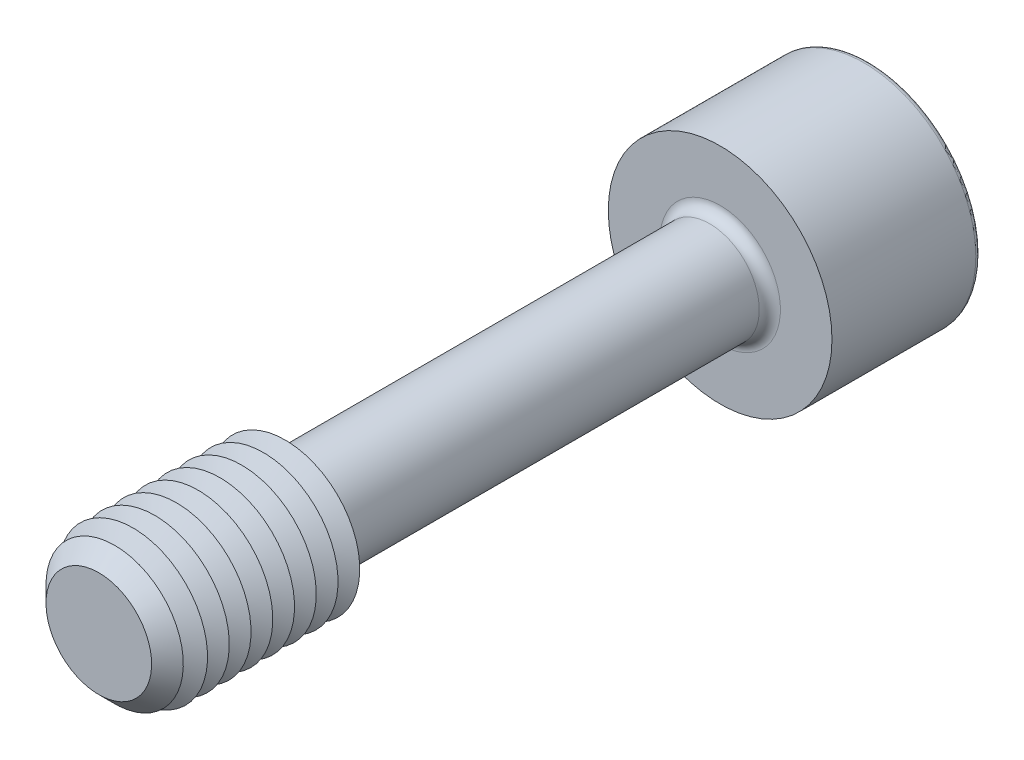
ISO-10303-21;
HEADER;
FILE_DESCRIPTION(('STEP AP214'),'2;1');
FILE_NAME('part.step','',(''),(''),'','','');
FILE_SCHEMA(('AUTOMOTIVE_DESIGN { 1 0 10303 214 1 1 1 1 }'));
ENDSEC;
DATA;
#1=APPLICATION_CONTEXT('core data for automotive mechanical design processes');
#2=APPLICATION_PROTOCOL_DEFINITION('international standard','automotive_design',2000,#1);
#3=PRODUCT_CONTEXT('',#1,'mechanical');
#4=PRODUCT('Part','Part','',(#3));
#5=PRODUCT_RELATED_PRODUCT_CATEGORY('part','',(#4));
#6=PRODUCT_DEFINITION_FORMATION('','',#4);
#7=PRODUCT_DEFINITION_CONTEXT('part definition',#1,'design');
#8=PRODUCT_DEFINITION('design','',#6,#7);
#9=PRODUCT_DEFINITION_SHAPE('','',#8);
#10=(LENGTH_UNIT() NAMED_UNIT(*) SI_UNIT(.MILLI.,.METRE.));
#11=(NAMED_UNIT(*) PLANE_ANGLE_UNIT() SI_UNIT($,.RADIAN.));
#12=(NAMED_UNIT(*) SI_UNIT($,.STERADIAN.) SOLID_ANGLE_UNIT());
#13=UNCERTAINTY_MEASURE_WITH_UNIT(LENGTH_MEASURE(1.E-05),#10,'distance_accuracy_value','');
#14=(GEOMETRIC_REPRESENTATION_CONTEXT(3) GLOBAL_UNCERTAINTY_ASSIGNED_CONTEXT((#13)) GLOBAL_UNIT_ASSIGNED_CONTEXT((#10,
#11,#12)) REPRESENTATION_CONTEXT('',''));
#15=CARTESIAN_POINT('',(0.,0.,0.));
#16=DIRECTION('',(0.,0.,1.));
#17=DIRECTION('',(1.,0.,0.));
#18=AXIS2_PLACEMENT_3D('',#15,#16,#17);
#19=CARTESIAN_POINT('',(-2.88675134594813,-5.,-27.));
#20=DIRECTION('',(0.,0.,1.));
#21=DIRECTION('',(1.,0.,0.));
#22=AXIS2_PLACEMENT_3D('',#19,#20,#21);
#23=PLANE('',#22);
#24=DIRECTION('',(1.,0.,0.));
#25=VECTOR('',#24,1.);
#26=CARTESIAN_POINT('',(-2.88675134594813,-5.,-27.));
#27=LINE('',#26,#25);
#28=CARTESIAN_POINT('',(0.,-5.,-27.));
#29=VERTEX_POINT('',#28);
#30=CARTESIAN_POINT('',(2.88675134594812,-5.,-27.));
#31=VERTEX_POINT('',#30);
#32=EDGE_CURVE('E762',#29,#31,#27,.T.);
#33=ORIENTED_EDGE('',*,*,#32,.F.);
#34=CARTESIAN_POINT('',(0.,0.,-27.));
#35=DIRECTION('',(0.,0.,1.));
#36=DIRECTION('',(0.,-1.,0.));
#37=AXIS2_PLACEMENT_3D('',#34,#35,#36);
#38=CIRCLE('',#37,5.);
#39=CARTESIAN_POINT('',(4.3301270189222,-2.5,-27.));
#40=VERTEX_POINT('',#39);
#41=EDGE_CURVE('E53',#29,#40,#38,.T.);
#42=ORIENTED_EDGE('',*,*,#41,.T.);
#43=DIRECTION('',(0.5,0.866025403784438,0.));
#44=VECTOR('',#43,1.);
#45=CARTESIAN_POINT('',(2.88675134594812,-5.,-27.));
#46=LINE('',#45,#44);
#47=EDGE_CURVE('E748',#31,#40,#46,.T.);
#48=ORIENTED_EDGE('',*,*,#47,.F.);
#49=EDGE_LOOP('',(#33,#42,#48));
#50=FACE_BOUND('',#49,.T.);
#51=ADVANCED_FACE('F41',(#50),#23,.F.);
#52=CARTESIAN_POINT('',(5.77350269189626,0.,-27.));
#53=VERTEX_POINT('',#52);
#54=EDGE_CURVE('E759',#40,#53,#46,.T.);
#55=ORIENTED_EDGE('',*,*,#54,.F.);
#56=CARTESIAN_POINT('',(4.3301270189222,2.50000000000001,-27.));
#57=VERTEX_POINT('',#56);
#58=EDGE_CURVE('E11',#40,#57,#38,.T.);
#59=ORIENTED_EDGE('',*,*,#58,.T.);
#60=DIRECTION('',(-0.5,0.866025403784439,0.));
#61=VECTOR('',#60,1.);
#62=CARTESIAN_POINT('',(5.77350269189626,0.,-27.));
#63=LINE('',#62,#61);
#64=EDGE_CURVE('E747',#53,#57,#63,.T.);
#65=ORIENTED_EDGE('',*,*,#64,.F.);
#66=EDGE_LOOP('',(#55,#59,#65));
#67=FACE_BOUND('',#66,.T.);
#68=ADVANCED_FACE('F133',(#67),#23,.F.);
#69=CARTESIAN_POINT('',(2.88675134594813,5.,-27.));
#70=VERTEX_POINT('',#69);
#71=EDGE_CURVE('E742',#57,#70,#63,.T.);
#72=ORIENTED_EDGE('',*,*,#71,.F.);
#73=CARTESIAN_POINT('',(0.,5.00000000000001,-27.));
#74=VERTEX_POINT('',#73);
#75=EDGE_CURVE('E51',#57,#74,#38,.T.);
#76=ORIENTED_EDGE('',*,*,#75,.T.);
#77=DIRECTION('',(-1.,0.,0.));
#78=VECTOR('',#77,1.);
#79=CARTESIAN_POINT('',(2.88675134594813,5.,-27.));
#80=LINE('',#79,#78);
#81=EDGE_CURVE('E177',#70,#74,#80,.T.);
#82=ORIENTED_EDGE('',*,*,#81,.F.);
#83=EDGE_LOOP('',(#72,#76,#82));
#84=FACE_BOUND('',#83,.T.);
#85=ADVANCED_FACE('F139',(#84),#23,.F.);
#86=CARTESIAN_POINT('',(-2.88675134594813,5.,-27.));
#87=VERTEX_POINT('',#86);
#88=EDGE_CURVE('E753',#74,#87,#80,.T.);
#89=ORIENTED_EDGE('',*,*,#88,.F.);
#90=CARTESIAN_POINT('',(-4.3301270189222,2.50000000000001,-27.));
#91=VERTEX_POINT('',#90);
#92=EDGE_CURVE('E266',#74,#91,#38,.T.);
#93=ORIENTED_EDGE('',*,*,#92,.T.);
#94=DIRECTION('',(-0.5,-0.866025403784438,0.));
#95=VECTOR('',#94,1.);
#96=CARTESIAN_POINT('',(-2.88675134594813,5.,-27.));
#97=LINE('',#96,#95);
#98=EDGE_CURVE('E176',#87,#91,#97,.T.);
#99=ORIENTED_EDGE('',*,*,#98,.F.);
#100=EDGE_LOOP('',(#89,#93,#99));
#101=FACE_BOUND('',#100,.T.);
#102=ADVANCED_FACE('F157',(#101),#23,.F.);
#103=CARTESIAN_POINT('',(-5.77350269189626,0.,-27.));
#104=VERTEX_POINT('',#103);
#105=EDGE_CURVE('E170',#91,#104,#97,.T.);
#106=ORIENTED_EDGE('',*,*,#105,.F.);
#107=CARTESIAN_POINT('',(-4.3301270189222,-2.5,-27.));
#108=VERTEX_POINT('',#107);
#109=EDGE_CURVE('E172',#91,#108,#38,.T.);
#110=ORIENTED_EDGE('',*,*,#109,.T.);
#111=DIRECTION('',(0.5,-0.866025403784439,0.));
#112=VECTOR('',#111,1.);
#113=CARTESIAN_POINT('',(-5.77350269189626,0.,-27.));
#114=LINE('',#113,#112);
#115=EDGE_CURVE('E174',#104,#108,#114,.T.);
#116=ORIENTED_EDGE('',*,*,#115,.F.);
#117=EDGE_LOOP('',(#106,#110,#116));
#118=FACE_BOUND('',#117,.T.);
#119=ADVANCED_FACE('F146',(#118),#23,.F.);
#120=CARTESIAN_POINT('',(0.,0.,-37.));
#121=DIRECTION('',(0.,0.,-1.));
#122=DIRECTION('',(-1.,0.,0.));
#123=AXIS2_PLACEMENT_3D('',#120,#121,#122);
#124=PLANE('',#123);
#125=CARTESIAN_POINT('',(0.,0.,-37.));
#126=DIRECTION('',(0.,0.,-1.));
#127=DIRECTION('',(-1.,0.,0.));
#128=AXIS2_PLACEMENT_3D('',#125,#126,#127);
#129=CIRCLE('',#128,8.575);
#130=CARTESIAN_POINT('',(-8.575,0.,-37.));
#131=VERTEX_POINT('',#130);
#132=EDGE_CURVE('E251',#131,#131,#129,.T.);
#133=ORIENTED_EDGE('',*,*,#132,.T.);
#134=EDGE_LOOP('',(#133));
#135=FACE_BOUND('',#134,.T.);
#136=DIRECTION('',(-0.5,-0.866025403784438,0.));
#137=VECTOR('',#136,1.);
#138=CARTESIAN_POINT('',(-2.88675134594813,5.,-37.));
#139=LINE('',#138,#137);
#140=CARTESIAN_POINT('',(-2.88675134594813,5.,-37.));
#141=VERTEX_POINT('',#140);
#142=CARTESIAN_POINT('',(-5.77350269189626,0.,-37.));
#143=VERTEX_POINT('',#142);
#144=EDGE_CURVE('E212',#141,#143,#139,.T.);
#145=ORIENTED_EDGE('',*,*,#144,.T.);
#146=DIRECTION('',(0.5,-0.866025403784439,0.));
#147=VECTOR('',#146,1.);
#148=CARTESIAN_POINT('',(-5.77350269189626,0.,-37.));
#149=LINE('',#148,#147);
#150=CARTESIAN_POINT('',(-2.88675134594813,-5.,-37.));
#151=VERTEX_POINT('',#150);
#152=EDGE_CURVE('E67',#143,#151,#149,.T.);
#153=ORIENTED_EDGE('',*,*,#152,.T.);
#154=DIRECTION('',(1.,0.,0.));
#155=VECTOR('',#154,1.);
#156=CARTESIAN_POINT('',(-2.88675134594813,-5.,-37.));
#157=LINE('',#156,#155);
#158=CARTESIAN_POINT('',(2.88675134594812,-5.,-37.));
#159=VERTEX_POINT('',#158);
#160=EDGE_CURVE('E196',#151,#159,#157,.T.);
#161=ORIENTED_EDGE('',*,*,#160,.T.);
#162=DIRECTION('',(0.5,0.866025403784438,0.));
#163=VECTOR('',#162,1.);
#164=CARTESIAN_POINT('',(2.88675134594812,-5.,-37.));
#165=LINE('',#164,#163);
#166=CARTESIAN_POINT('',(5.77350269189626,0.,-37.));
#167=VERTEX_POINT('',#166);
#168=EDGE_CURVE('E200',#159,#167,#165,.T.);
#169=ORIENTED_EDGE('',*,*,#168,.T.);
#170=DIRECTION('',(-0.5,0.866025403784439,0.));
#171=VECTOR('',#170,1.);
#172=CARTESIAN_POINT('',(5.77350269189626,0.,-37.));
#173=LINE('',#172,#171);
#174=CARTESIAN_POINT('',(2.88675134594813,5.,-37.));
#175=VERTEX_POINT('',#174);
#176=EDGE_CURVE('E204',#167,#175,#173,.T.);
#177=ORIENTED_EDGE('',*,*,#176,.T.);
#178=DIRECTION('',(-1.,0.,0.));
#179=VECTOR('',#178,1.);
#180=CARTESIAN_POINT('',(2.88675134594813,5.,-37.));
#181=LINE('',#180,#179);
#182=EDGE_CURVE('E208',#175,#141,#181,.T.);
#183=ORIENTED_EDGE('',*,*,#182,.T.);
#184=EDGE_LOOP('',(#145,#153,#161,#169,#177,#183));
#185=FACE_BOUND('',#184,.T.);
#186=ADVANCED_FACE('F156',(#135,#185),#124,.T.);
#187=CARTESIAN_POINT('',(0.,0.,25.));
#188=DIRECTION('',(0.,0.,-1.));
#189=DIRECTION('',(-1.,0.,0.));
#190=AXIS2_PLACEMENT_3D('',#187,#188,#189);
#191=CYLINDRICAL_SURFACE('',#190,4.);
#192=CARTESIAN_POINT('',(0.,0.,-24.15));
#193=DIRECTION('',(0.,0.,-1.));
#194=DIRECTION('',(-1.,0.,0.));
#195=AXIS2_PLACEMENT_3D('',#192,#193,#194);
#196=CIRCLE('',#195,4.);
#197=CARTESIAN_POINT('',(-4.,0.,-24.15));
#198=VERTEX_POINT('',#197);
#199=EDGE_CURVE('E247',#198,#198,#196,.F.);
#200=ORIENTED_EDGE('',*,*,#199,.T.);
#201=EDGE_LOOP('',(#200));
#202=FACE_BOUND('',#201,.T.);
#203=CARTESIAN_POINT('',(0.,0.,8.84529946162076));
#204=DIRECTION('',(0.,0.,-1.));
#205=DIRECTION('',(0.,1.,0.));
#206=AXIS2_PLACEMENT_3D('',#203,#204,#205);
#207=CIRCLE('',#206,4.);
#208=CARTESIAN_POINT('',(0.,4.,8.84529946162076));
#209=VERTEX_POINT('',#208);
#210=EDGE_CURVE('E235',#209,#209,#207,.T.);
#211=ORIENTED_EDGE('',*,*,#210,.T.);
#212=EDGE_LOOP('',(#211));
#213=FACE_BOUND('',#212,.T.);
#214=ADVANCED_FACE('F163',(#202,#213),#191,.T.);
#215=CARTESIAN_POINT('',(0.,0.,8.84529946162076));
#216=DIRECTION('',(0.,0.,1.));
#217=DIRECTION('',(0.,-1.,0.));
#218=AXIS2_PLACEMENT_3D('',#215,#216,#217);
#219=CONICAL_SURFACE('',#218,4.,1.0471975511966);
#220=CARTESIAN_POINT('',(0.,0.,10.));
#221=DIRECTION('',(0.,0.,-1.));
#222=DIRECTION('',(-1.,0.,0.));
#223=AXIS2_PLACEMENT_3D('',#220,#221,#222);
#224=CIRCLE('',#223,6.);
#225=CARTESIAN_POINT('',(-6.,0.,10.));
#226=VERTEX_POINT('',#225);
#227=EDGE_CURVE('E270',#226,#226,#224,.T.);
#228=ORIENTED_EDGE('',*,*,#227,.T.);
#229=EDGE_LOOP('',(#228));
#230=FACE_BOUND('',#229,.T.);
#231=ORIENTED_EDGE('',*,*,#210,.F.);
#232=EDGE_LOOP('',(#231));
#233=FACE_BOUND('',#232,.T.);
#234=ADVANCED_FACE('F511',(#230,#233),#219,.T.);
#235=CARTESIAN_POINT('',(0.,0.,-25.));
#236=DIRECTION('',(0.,0.,-1.));
#237=DIRECTION('',(-1.,0.,0.));
#238=AXIS2_PLACEMENT_3D('',#235,#236,#237);
#239=PLANE('',#238);
#240=CARTESIAN_POINT('',(0.,0.,-25.));
#241=DIRECTION('',(0.,0.,-1.));
#242=DIRECTION('',(-1.,0.,0.));
#243=AXIS2_PLACEMENT_3D('',#240,#241,#242);
#244=CIRCLE('',#243,4.85);
#245=CARTESIAN_POINT('',(-4.85,0.,-25.));
#246=VERTEX_POINT('',#245);
#247=EDGE_CURVE('E243',#246,#246,#244,.T.);
#248=ORIENTED_EDGE('',*,*,#247,.T.);
#249=EDGE_LOOP('',(#248));
#250=FACE_BOUND('',#249,.T.);
#251=CARTESIAN_POINT('',(0.,0.,-25.));
#252=DIRECTION('',(0.,0.,-1.));
#253=DIRECTION('',(-1.,0.,0.));
#254=AXIS2_PLACEMENT_3D('',#251,#252,#253);
#255=CIRCLE('',#254,9.);
#256=CARTESIAN_POINT('',(-9.,0.,-25.));
#257=VERTEX_POINT('',#256);
#258=EDGE_CURVE('E231',#257,#257,#255,.T.);
#259=ORIENTED_EDGE('',*,*,#258,.F.);
#260=EDGE_LOOP('',(#259));
#261=FACE_BOUND('',#260,.T.);
#262=ADVANCED_FACE('F504',(#250,#261),#239,.F.);
#263=CARTESIAN_POINT('',(0.,0.,-37.));
#264=DIRECTION('',(0.,0.,1.));
#265=DIRECTION('',(1.,0.,0.));
#266=AXIS2_PLACEMENT_3D('',#263,#264,#265);
#267=CYLINDRICAL_SURFACE('',#266,9.);
#268=CARTESIAN_POINT('',(0.,0.,-36.575));
#269=DIRECTION('',(0.,0.,-1.));
#270=DIRECTION('',(-1.,0.,0.));
#271=AXIS2_PLACEMENT_3D('',#268,#269,#270);
#272=CIRCLE('',#271,9.);
#273=CARTESIAN_POINT('',(-9.,0.,-36.575));
#274=VERTEX_POINT('',#273);
#275=EDGE_CURVE('E254',#274,#274,#272,.F.);
#276=ORIENTED_EDGE('',*,*,#275,.T.);
#277=EDGE_LOOP('',(#276));
#278=FACE_BOUND('',#277,.T.);
#279=ORIENTED_EDGE('',*,*,#258,.T.);
#280=EDGE_LOOP('',(#279));
#281=FACE_BOUND('',#280,.T.);
#282=ADVANCED_FACE('F510',(#278,#281),#267,.T.);
#283=CARTESIAN_POINT('',(-5.77350269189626,0.,-27.));
#284=DIRECTION('',(0.866025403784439,0.5,0.));
#285=DIRECTION('',(-0.5,0.866025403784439,0.));
#286=AXIS2_PLACEMENT_3D('',#283,#284,#285);
#287=PLANE('',#286);
#288=ORIENTED_EDGE('',*,*,#152,.F.);
#289=DIRECTION('',(0.,0.,-1.));
#290=VECTOR('',#289,1.);
#291=CARTESIAN_POINT('',(-5.77350269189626,0.,-27.));
#292=LINE('',#291,#290);
#293=EDGE_CURVE('E186',#104,#143,#292,.T.);
#294=ORIENTED_EDGE('',*,*,#293,.F.);
#295=ORIENTED_EDGE('',*,*,#115,.T.);
#296=CARTESIAN_POINT('',(-2.88675134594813,-5.,-27.));
#297=VERTEX_POINT('',#296);
#298=EDGE_CURVE('E215',#108,#297,#114,.T.);
#299=ORIENTED_EDGE('',*,*,#298,.T.);
#300=DIRECTION('',(0.,0.,-1.));
#301=VECTOR('',#300,1.);
#302=CARTESIAN_POINT('',(-2.88675134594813,-5.,-27.));
#303=LINE('',#302,#301);
#304=EDGE_CURVE('E228',#297,#151,#303,.T.);
#305=ORIENTED_EDGE('',*,*,#304,.T.);
#306=EDGE_LOOP('',(#288,#294,#295,#299,#305));
#307=FACE_BOUND('',#306,.T.);
#308=ADVANCED_FACE('F522',(#307),#287,.T.);
#309=CARTESIAN_POINT('',(-2.88675134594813,-5.,-27.));
#310=DIRECTION('',(0.,1.,0.));
#311=DIRECTION('',(0.,0.,1.));
#312=AXIS2_PLACEMENT_3D('',#309,#310,#311);
#313=PLANE('',#312);
#314=ORIENTED_EDGE('',*,*,#160,.F.);
#315=ORIENTED_EDGE('',*,*,#304,.F.);
#316=EDGE_CURVE('E760',#297,#29,#27,.T.);
#317=ORIENTED_EDGE('',*,*,#316,.T.);
#318=ORIENTED_EDGE('',*,*,#32,.T.);
#319=DIRECTION('',(0.,0.,-1.));
#320=VECTOR('',#319,1.);
#321=CARTESIAN_POINT('',(2.88675134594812,-5.,-27.));
#322=LINE('',#321,#320);
#323=EDGE_CURVE('E225',#31,#159,#322,.T.);
#324=ORIENTED_EDGE('',*,*,#323,.T.);
#325=EDGE_LOOP('',(#314,#315,#317,#318,#324));
#326=FACE_BOUND('',#325,.T.);
#327=ADVANCED_FACE('F538',(#326),#313,.T.);
#328=CARTESIAN_POINT('',(2.88675134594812,-5.,-27.));
#329=DIRECTION('',(-0.866025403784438,0.5,0.));
#330=DIRECTION('',(-0.5,-0.866025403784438,0.));
#331=AXIS2_PLACEMENT_3D('',#328,#329,#330);
#332=PLANE('',#331);
#333=ORIENTED_EDGE('',*,*,#168,.F.);
#334=ORIENTED_EDGE('',*,*,#323,.F.);
#335=ORIENTED_EDGE('',*,*,#47,.T.);
#336=ORIENTED_EDGE('',*,*,#54,.T.);
#337=DIRECTION('',(0.,0.,-1.));
#338=VECTOR('',#337,1.);
#339=CARTESIAN_POINT('',(5.77350269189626,0.,-27.));
#340=LINE('',#339,#338);
#341=EDGE_CURVE('E222',#53,#167,#340,.T.);
#342=ORIENTED_EDGE('',*,*,#341,.T.);
#343=EDGE_LOOP('',(#333,#334,#335,#336,#342));
#344=FACE_BOUND('',#343,.T.);
#345=ADVANCED_FACE('F548',(#344),#332,.T.);
#346=CARTESIAN_POINT('',(5.77350269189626,0.,-27.));
#347=DIRECTION('',(-0.866025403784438,-0.5,0.));
#348=DIRECTION('',(0.5,-0.866025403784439,0.));
#349=AXIS2_PLACEMENT_3D('',#346,#347,#348);
#350=PLANE('',#349);
#351=ORIENTED_EDGE('',*,*,#176,.F.);
#352=ORIENTED_EDGE('',*,*,#341,.F.);
#353=ORIENTED_EDGE('',*,*,#64,.T.);
#354=ORIENTED_EDGE('',*,*,#71,.T.);
#355=DIRECTION('',(0.,0.,-1.));
#356=VECTOR('',#355,1.);
#357=CARTESIAN_POINT('',(2.88675134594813,5.,-27.));
#358=LINE('',#357,#356);
#359=EDGE_CURVE('E219',#70,#175,#358,.T.);
#360=ORIENTED_EDGE('',*,*,#359,.T.);
#361=EDGE_LOOP('',(#351,#352,#353,#354,#360));
#362=FACE_BOUND('',#361,.T.);
#363=ADVANCED_FACE('F558',(#362),#350,.T.);
#364=CARTESIAN_POINT('',(2.88675134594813,5.,-27.));
#365=DIRECTION('',(0.,-1.,0.));
#366=DIRECTION('',(0.,0.,-1.));
#367=AXIS2_PLACEMENT_3D('',#364,#365,#366);
#368=PLANE('',#367);
#369=ORIENTED_EDGE('',*,*,#182,.F.);
#370=ORIENTED_EDGE('',*,*,#359,.F.);
#371=ORIENTED_EDGE('',*,*,#81,.T.);
#372=ORIENTED_EDGE('',*,*,#88,.T.);
#373=DIRECTION('',(0.,0.,-1.));
#374=VECTOR('',#373,1.);
#375=CARTESIAN_POINT('',(-2.88675134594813,5.,-27.));
#376=LINE('',#375,#374);
#377=EDGE_CURVE('E182',#87,#141,#376,.T.);
#378=ORIENTED_EDGE('',*,*,#377,.T.);
#379=EDGE_LOOP('',(#369,#370,#371,#372,#378));
#380=FACE_BOUND('',#379,.T.);
#381=ADVANCED_FACE('F152',(#380),#368,.T.);
#382=CARTESIAN_POINT('',(-2.88675134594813,5.,-27.));
#383=DIRECTION('',(0.866025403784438,-0.5,0.));
#384=DIRECTION('',(0.5,0.866025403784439,0.));
#385=AXIS2_PLACEMENT_3D('',#382,#383,#384);
#386=PLANE('',#385);
#387=ORIENTED_EDGE('',*,*,#144,.F.);
#388=ORIENTED_EDGE('',*,*,#377,.F.);
#389=ORIENTED_EDGE('',*,*,#98,.T.);
#390=ORIENTED_EDGE('',*,*,#105,.T.);
#391=ORIENTED_EDGE('',*,*,#293,.T.);
#392=EDGE_LOOP('',(#387,#388,#389,#390,#391));
#393=FACE_BOUND('',#392,.T.);
#394=ADVANCED_FACE('F144',(#393),#386,.T.);
#395=ORIENTED_EDGE('',*,*,#298,.F.);
#396=EDGE_CURVE('E257',#108,#29,#38,.T.);
#397=ORIENTED_EDGE('',*,*,#396,.T.);
#398=ORIENTED_EDGE('',*,*,#316,.F.);
#399=EDGE_LOOP('',(#395,#397,#398));
#400=FACE_BOUND('',#399,.T.);
#401=ADVANCED_FACE('F135',(#400),#23,.F.);
#402=CARTESIAN_POINT('',(0.,0.,-24.15));
#403=DIRECTION('',(0.,0.,-1.));
#404=DIRECTION('',(-1.,0.,0.));
#405=AXIS2_PLACEMENT_3D('',#402,#403,#404);
#406=TOROIDAL_SURFACE('',#405,4.85,0.85);
#407=ORIENTED_EDGE('',*,*,#199,.F.);
#408=EDGE_LOOP('',(#407));
#409=FACE_BOUND('',#408,.T.);
#410=ORIENTED_EDGE('',*,*,#247,.F.);
#411=EDGE_LOOP('',(#410));
#412=FACE_BOUND('',#411,.T.);
#413=ADVANCED_FACE('F129',(#409,#412),#406,.F.);
#414=CARTESIAN_POINT('',(0.,0.,-36.575));
#415=DIRECTION('',(0.,0.,-1.));
#416=DIRECTION('',(-1.,0.,0.));
#417=AXIS2_PLACEMENT_3D('',#414,#415,#416);
#418=TOROIDAL_SURFACE('',#417,8.575,0.425);
#419=ORIENTED_EDGE('',*,*,#275,.F.);
#420=EDGE_LOOP('',(#419));
#421=FACE_BOUND('',#420,.T.);
#422=ORIENTED_EDGE('',*,*,#132,.F.);
#423=EDGE_LOOP('',(#422));
#424=FACE_BOUND('',#423,.T.);
#425=ADVANCED_FACE('F43',(#421,#424),#418,.T.);
#426=CARTESIAN_POINT('',(0.,0.,-24.1132486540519));
#427=DIRECTION('',(0.,0.,-1.));
#428=DIRECTION('',(0.,1.,0.));
#429=AXIS2_PLACEMENT_3D('',#426,#427,#428);
#430=CONICAL_SURFACE('',#429,0.,1.04719755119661);
#431=ORIENTED_EDGE('',*,*,#41,.F.);
#432=ORIENTED_EDGE('',*,*,#396,.F.);
#433=ORIENTED_EDGE('',*,*,#109,.F.);
#434=ORIENTED_EDGE('',*,*,#92,.F.);
#435=ORIENTED_EDGE('',*,*,#75,.F.);
#436=ORIENTED_EDGE('',*,*,#58,.F.);
#437=EDGE_LOOP('',(#431,#432,#433,#434,#435,#436));
#438=FACE_BOUND('',#437,.T.);
#439=CARTESIAN_POINT('',(0.,0.,-24.1132486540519));
#440=VERTEX_POINT('',#439);
#441=VERTEX_LOOP('',#440);
#442=FACE_BOUND('',#441,.T.);
#443=ADVANCED_FACE('F118',(#438,#442),#430,.F.);
#444=CARTESIAN_POINT('',(0.,0.,10.875));
#445=DIRECTION('',(0.,0.,-1.));
#446=DIRECTION('',(-1.,0.,0.));
#447=AXIS2_PLACEMENT_3D('',#444,#445,#446);
#448=CONICAL_SURFACE('',#447,4.48445554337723,1.0471975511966);
#449=ORIENTED_EDGE('',*,*,#227,.F.);
#450=EDGE_LOOP('',(#449));
#451=FACE_BOUND('',#450,.T.);
#452=CARTESIAN_POINT('',(0.,0.,10.875));
#453=DIRECTION('',(0.,0.,-1.));
#454=DIRECTION('',(-1.,0.,0.));
#455=AXIS2_PLACEMENT_3D('',#452,#453,#454);
#456=CIRCLE('',#455,4.48445554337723);
#457=CARTESIAN_POINT('',(-4.48445554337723,0.,10.875));
#458=VERTEX_POINT('',#457);
#459=EDGE_CURVE('E276',#458,#458,#456,.T.);
#460=ORIENTED_EDGE('',*,*,#459,.T.);
#461=EDGE_LOOP('',(#460));
#462=FACE_BOUND('',#461,.T.);
#463=ADVANCED_FACE('F120',(#451,#462),#448,.T.);
#464=CARTESIAN_POINT('',(0.,0.,11.75));
#465=DIRECTION('',(0.,0.,1.));
#466=DIRECTION('',(1.,0.,0.));
#467=AXIS2_PLACEMENT_3D('',#464,#465,#466);
#468=CONICAL_SURFACE('',#467,6.,1.0471975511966);
#469=ORIENTED_EDGE('',*,*,#459,.F.);
#470=EDGE_LOOP('',(#469));
#471=FACE_BOUND('',#470,.T.);
#472=CARTESIAN_POINT('',(0.,0.,11.75));
#473=DIRECTION('',(0.,0.,-1.));
#474=DIRECTION('',(-1.,0.,0.));
#475=AXIS2_PLACEMENT_3D('',#472,#473,#474);
#476=CIRCLE('',#475,6.);
#477=CARTESIAN_POINT('',(-6.,0.,11.75));
#478=VERTEX_POINT('',#477);
#479=EDGE_CURVE('E282',#478,#478,#476,.T.);
#480=ORIENTED_EDGE('',*,*,#479,.T.);
#481=EDGE_LOOP('',(#480));
#482=FACE_BOUND('',#481,.T.);
#483=ADVANCED_FACE('F126',(#471,#482),#468,.T.);
#484=CARTESIAN_POINT('',(0.,0.,12.625));
#485=DIRECTION('',(0.,0.,-1.));
#486=DIRECTION('',(-1.,0.,0.));
#487=AXIS2_PLACEMENT_3D('',#484,#485,#486);
#488=CONICAL_SURFACE('',#487,4.48445554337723,1.0471975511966);
#489=ORIENTED_EDGE('',*,*,#479,.F.);
#490=EDGE_LOOP('',(#489));
#491=FACE_BOUND('',#490,.T.);
#492=CARTESIAN_POINT('',(0.,0.,12.625));
#493=DIRECTION('',(0.,0.,-1.));
#494=DIRECTION('',(-1.,0.,0.));
#495=AXIS2_PLACEMENT_3D('',#492,#493,#494);
#496=CIRCLE('',#495,4.48445554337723);
#497=CARTESIAN_POINT('',(-4.48445554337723,0.,12.625));
#498=VERTEX_POINT('',#497);
#499=EDGE_CURVE('E287',#498,#498,#496,.T.);
#500=ORIENTED_EDGE('',*,*,#499,.T.);
#501=EDGE_LOOP('',(#500));
#502=FACE_BOUND('',#501,.T.);
#503=ADVANCED_FACE('F398',(#491,#502),#488,.T.);
#504=CARTESIAN_POINT('',(0.,0.,13.5));
#505=DIRECTION('',(0.,0.,1.));
#506=DIRECTION('',(1.,0.,0.));
#507=AXIS2_PLACEMENT_3D('',#504,#505,#506);
#508=CONICAL_SURFACE('',#507,6.,1.0471975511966);
#509=ORIENTED_EDGE('',*,*,#499,.F.);
#510=EDGE_LOOP('',(#509));
#511=FACE_BOUND('',#510,.T.);
#512=CARTESIAN_POINT('',(0.,0.,13.5));
#513=DIRECTION('',(0.,0.,-1.));
#514=DIRECTION('',(-1.,0.,0.));
#515=AXIS2_PLACEMENT_3D('',#512,#513,#514);
#516=CIRCLE('',#515,6.);
#517=CARTESIAN_POINT('',(-6.,0.,13.5));
#518=VERTEX_POINT('',#517);
#519=EDGE_CURVE('E291',#518,#518,#516,.T.);
#520=ORIENTED_EDGE('',*,*,#519,.T.);
#521=EDGE_LOOP('',(#520));
#522=FACE_BOUND('',#521,.T.);
#523=ADVANCED_FACE('F394',(#511,#522),#508,.T.);
#524=CARTESIAN_POINT('',(0.,0.,14.375));
#525=DIRECTION('',(0.,0.,-1.));
#526=DIRECTION('',(-1.,0.,0.));
#527=AXIS2_PLACEMENT_3D('',#524,#525,#526);
#528=CONICAL_SURFACE('',#527,4.48445554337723,1.0471975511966);
#529=ORIENTED_EDGE('',*,*,#519,.F.);
#530=EDGE_LOOP('',(#529));
#531=FACE_BOUND('',#530,.T.);
#532=CARTESIAN_POINT('',(0.,0.,14.375));
#533=DIRECTION('',(0.,0.,-1.));
#534=DIRECTION('',(-1.,0.,0.));
#535=AXIS2_PLACEMENT_3D('',#532,#533,#534);
#536=CIRCLE('',#535,4.48445554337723);
#537=CARTESIAN_POINT('',(-4.48445554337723,0.,14.375));
#538=VERTEX_POINT('',#537);
#539=EDGE_CURVE('E295',#538,#538,#536,.T.);
#540=ORIENTED_EDGE('',*,*,#539,.T.);
#541=EDGE_LOOP('',(#540));
#542=FACE_BOUND('',#541,.T.);
#543=ADVANCED_FACE('F390',(#531,#542),#528,.T.);
#544=CARTESIAN_POINT('',(0.,0.,15.25));
#545=DIRECTION('',(0.,0.,1.));
#546=DIRECTION('',(1.,0.,0.));
#547=AXIS2_PLACEMENT_3D('',#544,#545,#546);
#548=CONICAL_SURFACE('',#547,6.,1.0471975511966);
#549=ORIENTED_EDGE('',*,*,#539,.F.);
#550=EDGE_LOOP('',(#549));
#551=FACE_BOUND('',#550,.T.);
#552=CARTESIAN_POINT('',(0.,0.,15.25));
#553=DIRECTION('',(0.,0.,-1.));
#554=DIRECTION('',(-1.,0.,0.));
#555=AXIS2_PLACEMENT_3D('',#552,#553,#554);
#556=CIRCLE('',#555,6.);
#557=CARTESIAN_POINT('',(-6.,0.,15.25));
#558=VERTEX_POINT('',#557);
#559=EDGE_CURVE('E299',#558,#558,#556,.T.);
#560=ORIENTED_EDGE('',*,*,#559,.T.);
#561=EDGE_LOOP('',(#560));
#562=FACE_BOUND('',#561,.T.);
#563=ADVANCED_FACE('F386',(#551,#562),#548,.T.);
#564=CARTESIAN_POINT('',(0.,0.,16.125));
#565=DIRECTION('',(0.,0.,-1.));
#566=DIRECTION('',(-1.,0.,0.));
#567=AXIS2_PLACEMENT_3D('',#564,#565,#566);
#568=CONICAL_SURFACE('',#567,4.48445554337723,1.0471975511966);
#569=ORIENTED_EDGE('',*,*,#559,.F.);
#570=EDGE_LOOP('',(#569));
#571=FACE_BOUND('',#570,.T.);
#572=CARTESIAN_POINT('',(0.,0.,16.125));
#573=DIRECTION('',(0.,0.,-1.));
#574=DIRECTION('',(-1.,0.,0.));
#575=AXIS2_PLACEMENT_3D('',#572,#573,#574);
#576=CIRCLE('',#575,4.48445554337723);
#577=CARTESIAN_POINT('',(-4.48445554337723,0.,16.125));
#578=VERTEX_POINT('',#577);
#579=EDGE_CURVE('E302',#578,#578,#576,.T.);
#580=ORIENTED_EDGE('',*,*,#579,.T.);
#581=EDGE_LOOP('',(#580));
#582=FACE_BOUND('',#581,.T.);
#583=ADVANCED_FACE('F382',(#571,#582),#568,.T.);
#584=CARTESIAN_POINT('',(0.,0.,17.));
#585=DIRECTION('',(0.,0.,1.));
#586=DIRECTION('',(1.,0.,0.));
#587=AXIS2_PLACEMENT_3D('',#584,#585,#586);
#588=CONICAL_SURFACE('',#587,6.,1.0471975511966);
#589=ORIENTED_EDGE('',*,*,#579,.F.);
#590=EDGE_LOOP('',(#589));
#591=FACE_BOUND('',#590,.T.);
#592=CARTESIAN_POINT('',(0.,0.,17.));
#593=DIRECTION('',(0.,0.,-1.));
#594=DIRECTION('',(-1.,0.,0.));
#595=AXIS2_PLACEMENT_3D('',#592,#593,#594);
#596=CIRCLE('',#595,6.);
#597=CARTESIAN_POINT('',(-6.,0.,17.));
#598=VERTEX_POINT('',#597);
#599=EDGE_CURVE('E306',#598,#598,#596,.T.);
#600=ORIENTED_EDGE('',*,*,#599,.T.);
#601=EDGE_LOOP('',(#600));
#602=FACE_BOUND('',#601,.T.);
#603=ADVANCED_FACE('F378',(#591,#602),#588,.T.);
#604=CARTESIAN_POINT('',(0.,0.,17.875));
#605=DIRECTION('',(0.,0.,-1.));
#606=DIRECTION('',(-1.,0.,0.));
#607=AXIS2_PLACEMENT_3D('',#604,#605,#606);
#608=CONICAL_SURFACE('',#607,4.48445554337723,1.0471975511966);
#609=ORIENTED_EDGE('',*,*,#599,.F.);
#610=EDGE_LOOP('',(#609));
#611=FACE_BOUND('',#610,.T.);
#612=CARTESIAN_POINT('',(0.,0.,17.875));
#613=DIRECTION('',(0.,0.,-1.));
#614=DIRECTION('',(-1.,0.,0.));
#615=AXIS2_PLACEMENT_3D('',#612,#613,#614);
#616=CIRCLE('',#615,4.48445554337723);
#617=CARTESIAN_POINT('',(-4.48445554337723,0.,17.875));
#618=VERTEX_POINT('',#617);
#619=EDGE_CURVE('E309',#618,#618,#616,.T.);
#620=ORIENTED_EDGE('',*,*,#619,.T.);
#621=EDGE_LOOP('',(#620));
#622=FACE_BOUND('',#621,.T.);
#623=ADVANCED_FACE('F374',(#611,#622),#608,.T.);
#624=CARTESIAN_POINT('',(0.,0.,18.75));
#625=DIRECTION('',(0.,0.,1.));
#626=DIRECTION('',(1.,0.,0.));
#627=AXIS2_PLACEMENT_3D('',#624,#625,#626);
#628=CONICAL_SURFACE('',#627,6.,1.0471975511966);
#629=ORIENTED_EDGE('',*,*,#619,.F.);
#630=EDGE_LOOP('',(#629));
#631=FACE_BOUND('',#630,.T.);
#632=CARTESIAN_POINT('',(0.,0.,18.75));
#633=DIRECTION('',(0.,0.,-1.));
#634=DIRECTION('',(-1.,0.,0.));
#635=AXIS2_PLACEMENT_3D('',#632,#633,#634);
#636=CIRCLE('',#635,6.);
#637=CARTESIAN_POINT('',(-6.,0.,18.75));
#638=VERTEX_POINT('',#637);
#639=EDGE_CURVE('E313',#638,#638,#636,.T.);
#640=ORIENTED_EDGE('',*,*,#639,.T.);
#641=EDGE_LOOP('',(#640));
#642=FACE_BOUND('',#641,.T.);
#643=ADVANCED_FACE('F370',(#631,#642),#628,.T.);
#644=CARTESIAN_POINT('',(0.,0.,19.625));
#645=DIRECTION('',(0.,0.,-1.));
#646=DIRECTION('',(-1.,0.,0.));
#647=AXIS2_PLACEMENT_3D('',#644,#645,#646);
#648=CONICAL_SURFACE('',#647,4.48445554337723,1.0471975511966);
#649=ORIENTED_EDGE('',*,*,#639,.F.);
#650=EDGE_LOOP('',(#649));
#651=FACE_BOUND('',#650,.T.);
#652=CARTESIAN_POINT('',(0.,0.,19.625));
#653=DIRECTION('',(0.,0.,-1.));
#654=DIRECTION('',(-1.,0.,0.));
#655=AXIS2_PLACEMENT_3D('',#652,#653,#654);
#656=CIRCLE('',#655,4.48445554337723);
#657=CARTESIAN_POINT('',(-4.48445554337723,0.,19.625));
#658=VERTEX_POINT('',#657);
#659=EDGE_CURVE('E316',#658,#658,#656,.T.);
#660=ORIENTED_EDGE('',*,*,#659,.T.);
#661=EDGE_LOOP('',(#660));
#662=FACE_BOUND('',#661,.T.);
#663=ADVANCED_FACE('F366',(#651,#662),#648,.T.);
#664=CARTESIAN_POINT('',(0.,0.,20.5));
#665=DIRECTION('',(0.,0.,1.));
#666=DIRECTION('',(1.,0.,0.));
#667=AXIS2_PLACEMENT_3D('',#664,#665,#666);
#668=CONICAL_SURFACE('',#667,6.,1.0471975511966);
#669=ORIENTED_EDGE('',*,*,#659,.F.);
#670=EDGE_LOOP('',(#669));
#671=FACE_BOUND('',#670,.T.);
#672=CARTESIAN_POINT('',(0.,0.,20.5));
#673=DIRECTION('',(0.,0.,-1.));
#674=DIRECTION('',(-1.,0.,0.));
#675=AXIS2_PLACEMENT_3D('',#672,#673,#674);
#676=CIRCLE('',#675,6.);
#677=CARTESIAN_POINT('',(-6.,0.,20.5));
#678=VERTEX_POINT('',#677);
#679=EDGE_CURVE('E320',#678,#678,#676,.T.);
#680=ORIENTED_EDGE('',*,*,#679,.T.);
#681=EDGE_LOOP('',(#680));
#682=FACE_BOUND('',#681,.T.);
#683=ADVANCED_FACE('F362',(#671,#682),#668,.T.);
#684=CARTESIAN_POINT('',(0.,0.,21.375));
#685=DIRECTION('',(0.,0.,-1.));
#686=DIRECTION('',(-1.,0.,0.));
#687=AXIS2_PLACEMENT_3D('',#684,#685,#686);
#688=CONICAL_SURFACE('',#687,4.48445554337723,1.0471975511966);
#689=ORIENTED_EDGE('',*,*,#679,.F.);
#690=EDGE_LOOP('',(#689));
#691=FACE_BOUND('',#690,.T.);
#692=CARTESIAN_POINT('',(0.,0.,21.375));
#693=DIRECTION('',(0.,0.,-1.));
#694=DIRECTION('',(-1.,0.,0.));
#695=AXIS2_PLACEMENT_3D('',#692,#693,#694);
#696=CIRCLE('',#695,4.48445554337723);
#697=CARTESIAN_POINT('',(-4.48445554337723,0.,21.375));
#698=VERTEX_POINT('',#697);
#699=EDGE_CURVE('E324',#698,#698,#696,.T.);
#700=ORIENTED_EDGE('',*,*,#699,.T.);
#701=EDGE_LOOP('',(#700));
#702=FACE_BOUND('',#701,.T.);
#703=ADVANCED_FACE('F358',(#691,#702),#688,.T.);
#704=CARTESIAN_POINT('',(0.,0.,22.25));
#705=DIRECTION('',(0.,0.,1.));
#706=DIRECTION('',(1.,0.,0.));
#707=AXIS2_PLACEMENT_3D('',#704,#705,#706);
#708=CONICAL_SURFACE('',#707,6.,1.0471975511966);
#709=ORIENTED_EDGE('',*,*,#699,.F.);
#710=EDGE_LOOP('',(#709));
#711=FACE_BOUND('',#710,.T.);
#712=CARTESIAN_POINT('',(0.,0.,22.25));
#713=DIRECTION('',(0.,0.,-1.));
#714=DIRECTION('',(-1.,0.,0.));
#715=AXIS2_PLACEMENT_3D('',#712,#713,#714);
#716=CIRCLE('',#715,6.);
#717=CARTESIAN_POINT('',(-6.,0.,22.25));
#718=VERTEX_POINT('',#717);
#719=EDGE_CURVE('E328',#718,#718,#716,.T.);
#720=ORIENTED_EDGE('',*,*,#719,.T.);
#721=EDGE_LOOP('',(#720));
#722=FACE_BOUND('',#721,.T.);
#723=ADVANCED_FACE('F351',(#711,#722),#708,.T.);
#724=CARTESIAN_POINT('',(0.,0.,23.125));
#725=DIRECTION('',(0.,0.,-1.));
#726=DIRECTION('',(-1.,0.,0.));
#727=AXIS2_PLACEMENT_3D('',#724,#725,#726);
#728=CONICAL_SURFACE('',#727,4.48445554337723,1.0471975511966);
#729=ORIENTED_EDGE('',*,*,#719,.F.);
#730=EDGE_LOOP('',(#729));
#731=FACE_BOUND('',#730,.T.);
#732=CARTESIAN_POINT('',(0.,0.,23.125));
#733=DIRECTION('',(0.,0.,-1.));
#734=DIRECTION('',(-1.,0.,0.));
#735=AXIS2_PLACEMENT_3D('',#732,#733,#734);
#736=CIRCLE('',#735,4.48445554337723);
#737=CARTESIAN_POINT('',(-4.48445554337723,0.,23.125));
#738=VERTEX_POINT('',#737);
#739=EDGE_CURVE('E332',#738,#738,#736,.T.);
#740=ORIENTED_EDGE('',*,*,#739,.T.);
#741=EDGE_LOOP('',(#740));
#742=FACE_BOUND('',#741,.T.);
#743=ADVANCED_FACE('F337',(#731,#742),#728,.T.);
#744=CARTESIAN_POINT('',(0.,0.,24.));
#745=DIRECTION('',(0.,0.,1.));
#746=DIRECTION('',(1.,0.,0.));
#747=AXIS2_PLACEMENT_3D('',#744,#745,#746);
#748=CONICAL_SURFACE('',#747,6.,1.0471975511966);
#749=CARTESIAN_POINT('',(0.,0.,23.7254809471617));
#750=DIRECTION('',(0.,0.,1.));
#751=DIRECTION('',(1.,0.,0.));
#752=AXIS2_PLACEMENT_3D('',#749,#750,#751);
#753=CIRCLE('',#752,5.52451905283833);
#754=CARTESIAN_POINT('',(0.,5.52451905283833,23.7254809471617));
#755=VERTEX_POINT('',#754);
#756=EDGE_CURVE('E45',#755,#755,#753,.F.);
#757=ORIENTED_EDGE('',*,*,#756,.T.);
#758=EDGE_LOOP('',(#757));
#759=FACE_BOUND('',#758,.T.);
#760=ORIENTED_EDGE('',*,*,#739,.F.);
#761=EDGE_LOOP('',(#760));
#762=FACE_BOUND('',#761,.T.);
#763=ADVANCED_FACE('F339',(#759,#762),#748,.T.);
#764=CARTESIAN_POINT('',(0.,0.,25.));
#765=DIRECTION('',(0.,0.,1.));
#766=DIRECTION('',(1.,0.,0.));
#767=AXIS2_PLACEMENT_3D('',#764,#765,#766);
#768=PLANE('',#767);
#769=CARTESIAN_POINT('',(0.,0.,25.));
#770=DIRECTION('',(0.,0.,1.));
#771=DIRECTION('',(1.,0.,0.));
#772=AXIS2_PLACEMENT_3D('',#769,#770,#771);
#773=CIRCLE('',#772,4.25);
#774=CARTESIAN_POINT('',(0.,4.24999999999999,25.));
#775=VERTEX_POINT('',#774);
#776=EDGE_CURVE('E239',#775,#775,#773,.T.);
#777=ORIENTED_EDGE('',*,*,#776,.T.);
#778=EDGE_LOOP('',(#777));
#779=FACE_BOUND('',#778,.T.);
#780=ADVANCED_FACE('F341',(#779),#768,.T.);
#781=CARTESIAN_POINT('',(0.,0.,23.25));
#782=DIRECTION('',(0.,0.,-1.));
#783=DIRECTION('',(0.,1.,0.));
#784=AXIS2_PLACEMENT_3D('',#781,#782,#783);
#785=CONICAL_SURFACE('',#784,6.,0.785398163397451);
#786=CARTESIAN_POINT('',(0.,5.52451905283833,23.7254809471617));
#787=CARTESIAN_POINT('',(0.,5.5112428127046,23.7387571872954));
#788=CARTESIAN_POINT('',(0.,5.49796657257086,23.7520334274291));
#789=CARTESIAN_POINT('',(0.,5.4714140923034,23.7785859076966));
#790=CARTESIAN_POINT('',(0.,5.45813785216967,23.7918621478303));
#791=CARTESIAN_POINT('',(0.,5.4315853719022,23.8184146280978));
#792=CARTESIAN_POINT('',(0.,5.41830913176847,23.8316908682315));
#793=CARTESIAN_POINT('',(0.,5.391756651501,23.858243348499));
#794=CARTESIAN_POINT('',(0.,5.37848041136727,23.8715195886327));
#795=CARTESIAN_POINT('',(0.,5.35192793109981,23.8980720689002));
#796=CARTESIAN_POINT('',(0.,5.33865169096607,23.9113483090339));
#797=CARTESIAN_POINT('',(0.,5.31209921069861,23.9379007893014));
#798=CARTESIAN_POINT('',(0.,5.29882297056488,23.9511770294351));
#799=CARTESIAN_POINT('',(0.,5.27227049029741,23.9777295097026));
#800=CARTESIAN_POINT('',(0.,5.25899425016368,23.9910057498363));
#801=CARTESIAN_POINT('',(0.,5.23244176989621,24.0175582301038));
#802=CARTESIAN_POINT('',(0.,5.21916552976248,24.0308344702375));
#803=CARTESIAN_POINT('',(0.,5.19261304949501,24.057386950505));
#804=CARTESIAN_POINT('',(0.,5.17933680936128,24.0706631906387));
#805=CARTESIAN_POINT('',(0.,5.15278432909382,24.0972156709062));
#806=CARTESIAN_POINT('',(0.,5.13950808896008,24.1104919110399));
#807=CARTESIAN_POINT('',(0.,5.11295560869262,24.1370443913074));
#808=CARTESIAN_POINT('',(0.,5.09967936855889,24.1503206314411));
#809=CARTESIAN_POINT('',(0.,5.07312688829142,24.1768731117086));
#810=CARTESIAN_POINT('',(0.,5.05985064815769,24.1901493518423));
#811=CARTESIAN_POINT('',(0.,5.03329816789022,24.2167018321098));
#812=CARTESIAN_POINT('',(0.,5.02002192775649,24.2299780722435));
#813=CARTESIAN_POINT('',(0.,4.99346944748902,24.256530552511));
#814=CARTESIAN_POINT('',(0.,4.98019320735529,24.2698067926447));
#815=CARTESIAN_POINT('',(0.,4.95364072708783,24.2963592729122));
#816=CARTESIAN_POINT('',(0.,4.94036448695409,24.3096355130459));
#817=CARTESIAN_POINT('',(0.,4.91381200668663,24.3361879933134));
#818=CARTESIAN_POINT('',(0.,4.9005357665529,24.3494642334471));
#819=CARTESIAN_POINT('',(0.,4.87398328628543,24.3760167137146));
#820=CARTESIAN_POINT('',(0.,4.8607070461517,24.3892929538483));
#821=CARTESIAN_POINT('',(0.,4.83415456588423,24.4158454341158));
#822=CARTESIAN_POINT('',(0.,4.8208783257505,24.4291216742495));
#823=CARTESIAN_POINT('',(0.,4.79432584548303,24.455674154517));
#824=CARTESIAN_POINT('',(0.,4.7810496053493,24.4689503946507));
#825=CARTESIAN_POINT('',(0.,4.75449712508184,24.4955028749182));
#826=CARTESIAN_POINT('',(0.,4.7412208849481,24.5087791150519));
#827=CARTESIAN_POINT('',(0.,4.71466840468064,24.5353315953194));
#828=CARTESIAN_POINT('',(0.,4.70139216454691,24.5486078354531));
#829=CARTESIAN_POINT('',(0.,4.67483968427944,24.5751603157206));
#830=CARTESIAN_POINT('',(0.,4.66156344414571,24.5884365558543));
#831=CARTESIAN_POINT('',(0.,4.63501096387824,24.6149890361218));
#832=CARTESIAN_POINT('',(0.,4.62173472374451,24.6282652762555));
#833=CARTESIAN_POINT('',(0.,4.59518224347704,24.654817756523));
#834=CARTESIAN_POINT('',(0.,4.58190600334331,24.6680939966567));
#835=CARTESIAN_POINT('',(0.,4.55535352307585,24.6946464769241));
#836=CARTESIAN_POINT('',(0.,4.54207728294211,24.7079227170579));
#837=CARTESIAN_POINT('',(0.,4.51552480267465,24.7344751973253));
#838=CARTESIAN_POINT('',(0.,4.50224856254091,24.7477514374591));
#839=CARTESIAN_POINT('',(0.,4.47569608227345,24.7743039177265));
#840=CARTESIAN_POINT('',(0.,4.46241984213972,24.7875801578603));
#841=CARTESIAN_POINT('',(0.,4.43586736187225,24.8141326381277));
#842=CARTESIAN_POINT('',(0.,4.42259112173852,24.8274088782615));
#843=CARTESIAN_POINT('',(0.,4.39603864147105,24.8539613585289));
#844=CARTESIAN_POINT('',(0.,4.38276240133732,24.8672375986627));
#845=CARTESIAN_POINT('',(0.,4.35620992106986,24.8937900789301));
#846=CARTESIAN_POINT('',(0.,4.34293368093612,24.9070663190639));
#847=CARTESIAN_POINT('',(0.,4.31638120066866,24.9336187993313));
#848=CARTESIAN_POINT('',(0.,4.30310496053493,24.9468950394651));
#849=CARTESIAN_POINT('',(0.,4.27655248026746,24.9734475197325));
#850=CARTESIAN_POINT('',(0.,4.26327624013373,24.9867237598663));
#851=CARTESIAN_POINT('',(0.,4.24999999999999,25.));
#852=B_SPLINE_CURVE_WITH_KNOTS('',3,(#786,#787,#788,#789,#790,#791,#792,#793,#794,#795,#796,
#797,#798,#799,#800,#801,#802,#803,#804,#805,#806,#807,#808,#809,#810,#811,#812,#813,#814,#815,
#816,#817,#818,#819,#820,#821,#822,#823,#824,#825,#826,#827,#828,#829,#830,#831,#832,#833,#834,
#835,#836,#837,#838,#839,#840,#841,#842,#843,#844,#845,#846,#847,#848,#849,#850,#851),
.UNSPECIFIED.,.F.,.F.,(4,2,2,2,2,2,2,2,2,2,2,2,2,2,2,2,2,2,2,2,2,2,2,2,2,2,2,2,2,2,2,2,4),(0.,
0.0563263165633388,0.112652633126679,0.168978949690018,0.22530526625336,0.281631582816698,
0.337957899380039,0.39428421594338,0.450610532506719,0.50693684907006,0.563263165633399,
0.619589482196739,0.67591579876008,0.732242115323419,0.78856843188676,0.844894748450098,
0.90122106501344,0.957547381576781,1.01387369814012,1.07020001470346,1.1265263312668,
1.18285264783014,1.23917896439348,1.29550528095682,1.35183159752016,1.4081579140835,
1.46448423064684,1.52081054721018,1.57713686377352,1.63346318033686,1.6897894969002,
1.74611581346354,1.80244213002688),.UNSPECIFIED.);
#853=EDGE_CURVE('BSEAM348',#755,#775,#852,.T.);
#854=ORIENTED_EDGE('',*,*,#756,.F.);
#855=ORIENTED_EDGE('',*,*,#776,.F.);
#856=ORIENTED_EDGE('',*,*,#853,.T.);
#857=ORIENTED_EDGE('',*,*,#853,.F.);
#858=EDGE_LOOP('',(#854,#856,#855,#857));
#859=FACE_BOUND('',#858,.T.);
#860=ADVANCED_FACE('F348',(#859),#785,.T.);
#861=CLOSED_SHELL('',(#51,#68,#85,#102,#119,#186,#214,#234,#262,#282,#308,#327,#345,#363,#381,
#394,#401,#413,#425,#443,#463,#483,#503,#523,#543,#563,#583,#603,#623,#643,#663,#683,#703,#723,
#743,#763,#780,#860));
#862=MANIFOLD_SOLID_BREP('B2',#861);
#863=ADVANCED_BREP_SHAPE_REPRESENTATION('',(#18,#862),#14);
#864=SHAPE_DEFINITION_REPRESENTATION(#9,#863);
ENDSEC;
END-ISO-10303-21;
